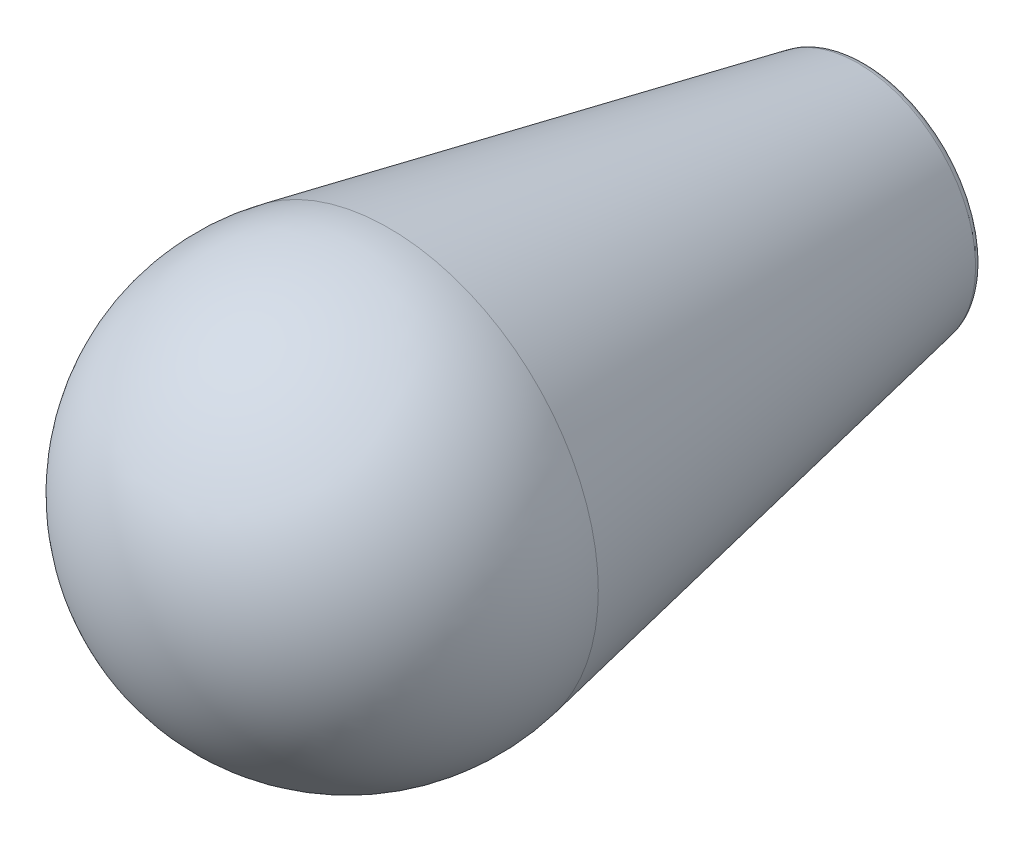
ISO-10303-21;
HEADER;
FILE_DESCRIPTION(('STEP AP214'),'2;1');
FILE_NAME('part.step','',(''),(''),'','','');
FILE_SCHEMA(('AUTOMOTIVE_DESIGN { 1 0 10303 214 1 1 1 1 }'));
ENDSEC;
DATA;
#1=APPLICATION_CONTEXT('core data for automotive mechanical design processes');
#2=APPLICATION_PROTOCOL_DEFINITION('international standard','automotive_design',2000,#1);
#3=PRODUCT_CONTEXT('',#1,'mechanical');
#4=PRODUCT('Part','Part','',(#3));
#5=PRODUCT_RELATED_PRODUCT_CATEGORY('part','',(#4));
#6=PRODUCT_DEFINITION_FORMATION('','',#4);
#7=PRODUCT_DEFINITION_CONTEXT('part definition',#1,'design');
#8=PRODUCT_DEFINITION('design','',#6,#7);
#9=PRODUCT_DEFINITION_SHAPE('','',#8);
#10=(LENGTH_UNIT() NAMED_UNIT(*) SI_UNIT(.MILLI.,.METRE.));
#11=(NAMED_UNIT(*) PLANE_ANGLE_UNIT() SI_UNIT($,.RADIAN.));
#12=(NAMED_UNIT(*) SI_UNIT($,.STERADIAN.) SOLID_ANGLE_UNIT());
#13=UNCERTAINTY_MEASURE_WITH_UNIT(LENGTH_MEASURE(1.E-05),#10,'distance_accuracy_value','');
#14=(GEOMETRIC_REPRESENTATION_CONTEXT(3) GLOBAL_UNCERTAINTY_ASSIGNED_CONTEXT((#13)) GLOBAL_UNIT_ASSIGNED_CONTEXT((#10,
#11,#12)) REPRESENTATION_CONTEXT('',''));
#15=CARTESIAN_POINT('',(0.,0.,0.));
#16=DIRECTION('',(0.,0.,1.));
#17=DIRECTION('',(1.,0.,0.));
#18=AXIS2_PLACEMENT_3D('',#15,#16,#17);
#19=CARTESIAN_POINT('',(0.,0.,42.5));
#20=DIRECTION('',(0.,0.,1.));
#21=DIRECTION('',(1.,0.,0.));
#22=AXIS2_PLACEMENT_3D('',#19,#20,#21);
#23=SPHERICAL_SURFACE('',#22,17.5);
#24=CARTESIAN_POINT('',(0.,0.,39.1327879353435));
#25=DIRECTION('',(0.,0.,1.));
#26=DIRECTION('',(0.,-1.,0.));
#27=AXIS2_PLACEMENT_3D('',#24,#25,#26);
#28=CIRCLE('',#27,17.1729986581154);
#29=CARTESIAN_POINT('',(0.,-17.1729986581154,39.1327879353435));
#30=VERTEX_POINT('',#29);
#31=EDGE_CURVE('E37',#30,#30,#28,.T.);
#32=ORIENTED_EDGE('',*,*,#31,.T.);
#33=EDGE_LOOP('',(#32));
#34=FACE_BOUND('',#33,.T.);
#35=ADVANCED_FACE('F12',(#34),#23,.T.);
#36=CARTESIAN_POINT('',(5.,0.,35.));
#37=DIRECTION('',(0.,0.,1.));
#38=DIRECTION('',(0.,-1.,0.));
#39=AXIS2_PLACEMENT_3D('',#36,#37,#38);
#40=PLANE('',#39);
#41=CARTESIAN_POINT('',(0.,0.,35.));
#42=DIRECTION('',(0.,0.,1.));
#43=DIRECTION('',(0.,-1.,0.));
#44=AXIS2_PLACEMENT_3D('',#41,#42,#43);
#45=CIRCLE('',#44,5.);
#46=CARTESIAN_POINT('',(0.,-5.,35.));
#47=VERTEX_POINT('',#46);
#48=EDGE_CURVE('E8',#47,#47,#45,.T.);
#49=ORIENTED_EDGE('',*,*,#48,.F.);
#50=EDGE_LOOP('',(#49));
#51=FACE_BOUND('',#50,.T.);
#52=ADVANCED_FACE('F75',(#51),#40,.F.);
#53=CARTESIAN_POINT('',(0.,0.,60.));
#54=DIRECTION('',(0.,0.,1.));
#55=DIRECTION('',(0.,-1.,0.));
#56=AXIS2_PLACEMENT_3D('',#53,#54,#55);
#57=CYLINDRICAL_SURFACE('',#56,5.);
#58=CARTESIAN_POINT('',(0.,0.,8.));
#59=DIRECTION('',(0.,0.,1.));
#60=DIRECTION('',(0.,-1.,0.));
#61=AXIS2_PLACEMENT_3D('',#58,#59,#60);
#62=CIRCLE('',#61,5.);
#63=CARTESIAN_POINT('',(0.,-5.,8.));
#64=VERTEX_POINT('',#63);
#65=EDGE_CURVE('E18',#64,#64,#62,.T.);
#66=ORIENTED_EDGE('',*,*,#65,.F.);
#67=EDGE_LOOP('',(#66));
#68=FACE_BOUND('',#67,.T.);
#69=ORIENTED_EDGE('',*,*,#48,.T.);
#70=EDGE_LOOP('',(#69));
#71=FACE_BOUND('',#70,.T.);
#72=ADVANCED_FACE('F68',(#68,#71),#57,.F.);
#73=CARTESIAN_POINT('',(5.25,0.,8.));
#74=DIRECTION('',(0.,0.,1.));
#75=DIRECTION('',(0.,-1.,0.));
#76=AXIS2_PLACEMENT_3D('',#73,#74,#75);
#77=PLANE('',#76);
#78=CARTESIAN_POINT('',(0.,0.,8.));
#79=DIRECTION('',(0.,0.,1.));
#80=DIRECTION('',(0.,-1.,0.));
#81=AXIS2_PLACEMENT_3D('',#78,#79,#80);
#82=CIRCLE('',#81,5.25);
#83=CARTESIAN_POINT('',(0.,-5.25,8.));
#84=VERTEX_POINT('',#83);
#85=EDGE_CURVE('E22',#84,#84,#82,.T.);
#86=ORIENTED_EDGE('',*,*,#85,.F.);
#87=EDGE_LOOP('',(#86));
#88=FACE_BOUND('',#87,.T.);
#89=ORIENTED_EDGE('',*,*,#65,.T.);
#90=EDGE_LOOP('',(#89));
#91=FACE_BOUND('',#90,.T.);
#92=ADVANCED_FACE('F63',(#88,#91),#77,.F.);
#93=CARTESIAN_POINT('',(0.,0.,60.));
#94=DIRECTION('',(0.,0.,1.));
#95=DIRECTION('',(0.,-1.,0.));
#96=AXIS2_PLACEMENT_3D('',#93,#94,#95);
#97=CYLINDRICAL_SURFACE('',#96,5.25);
#98=CARTESIAN_POINT('',(0.,0.,0.));
#99=DIRECTION('',(0.,0.,1.));
#100=DIRECTION('',(0.,-1.,0.));
#101=AXIS2_PLACEMENT_3D('',#98,#99,#100);
#102=CIRCLE('',#101,5.25);
#103=CARTESIAN_POINT('',(0.,-5.25,0.));
#104=VERTEX_POINT('',#103);
#105=EDGE_CURVE('E26',#104,#104,#102,.T.);
#106=ORIENTED_EDGE('',*,*,#105,.F.);
#107=EDGE_LOOP('',(#106));
#108=FACE_BOUND('',#107,.T.);
#109=ORIENTED_EDGE('',*,*,#85,.T.);
#110=EDGE_LOOP('',(#109));
#111=FACE_BOUND('',#110,.T.);
#112=ADVANCED_FACE('F57',(#108,#111),#97,.F.);
#113=CARTESIAN_POINT('',(5.25,0.,0.));
#114=DIRECTION('',(0.,0.,1.));
#115=DIRECTION('',(0.,-1.,0.));
#116=AXIS2_PLACEMENT_3D('',#113,#114,#115);
#117=PLANE('',#116);
#118=CARTESIAN_POINT('',(0.,0.,0.));
#119=DIRECTION('',(0.,0.,1.));
#120=DIRECTION('',(0.,-1.,0.));
#121=AXIS2_PLACEMENT_3D('',#118,#119,#120);
#122=CIRCLE('',#121,8.84162748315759);
#123=CARTESIAN_POINT('',(0.,-8.84162748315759,0.));
#124=VERTEX_POINT('',#123);
#125=EDGE_CURVE('E31',#124,#124,#122,.T.);
#126=ORIENTED_EDGE('',*,*,#125,.F.);
#127=EDGE_LOOP('',(#126));
#128=FACE_BOUND('',#127,.T.);
#129=ORIENTED_EDGE('',*,*,#105,.T.);
#130=EDGE_LOOP('',(#129));
#131=FACE_BOUND('',#130,.T.);
#132=ADVANCED_FACE('F51',(#128,#131),#117,.F.);
#133=CARTESIAN_POINT('',(0.,0.,0.8));
#134=DIRECTION('',(0.,0.,1.));
#135=DIRECTION('',(0.,-1.,0.));
#136=AXIS2_PLACEMENT_3D('',#133,#134,#135);
#137=TOROIDAL_SURFACE('',#136,8.84162748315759,0.8);
#138=CARTESIAN_POINT('',(0.,0.,0.646070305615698));
#139=DIRECTION('',(0.,0.,1.));
#140=DIRECTION('',(0.,-1.,0.));
#141=AXIS2_PLACEMENT_3D('',#138,#139,#140);
#142=CIRCLE('',#141,9.62667885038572);
#143=CARTESIAN_POINT('',(0.,-9.62667885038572,0.646070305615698));
#144=VERTEX_POINT('',#143);
#145=EDGE_CURVE('E34',#144,#144,#142,.T.);
#146=ORIENTED_EDGE('',*,*,#145,.F.);
#147=EDGE_LOOP('',(#146));
#148=FACE_BOUND('',#147,.T.);
#149=ORIENTED_EDGE('',*,*,#125,.T.);
#150=EDGE_LOOP('',(#149));
#151=FACE_BOUND('',#150,.T.);
#152=ADVANCED_FACE('F45',(#148,#151),#137,.T.);
#153=CARTESIAN_POINT('',(0.,0.,0.646070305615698));
#154=DIRECTION('',(0.,0.,1.));
#155=DIRECTION('',(0.,-1.,0.));
#156=AXIS2_PLACEMENT_3D('',#153,#154,#155);
#157=CONICAL_SURFACE('',#156,9.62667885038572,0.193619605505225);
#158=ORIENTED_EDGE('',*,*,#31,.F.);
#159=EDGE_LOOP('',(#158));
#160=FACE_BOUND('',#159,.T.);
#161=ORIENTED_EDGE('',*,*,#145,.T.);
#162=EDGE_LOOP('',(#161));
#163=FACE_BOUND('',#162,.T.);
#164=ADVANCED_FACE('F42',(#160,#163),#157,.T.);
#165=CLOSED_SHELL('',(#35,#52,#72,#92,#112,#132,#152,#164));
#166=MANIFOLD_SOLID_BREP('B1',#165);
#167=ADVANCED_BREP_SHAPE_REPRESENTATION('',(#18,#166),#14);
#168=SHAPE_DEFINITION_REPRESENTATION(#9,#167);
ENDSEC;
END-ISO-10303-21;
